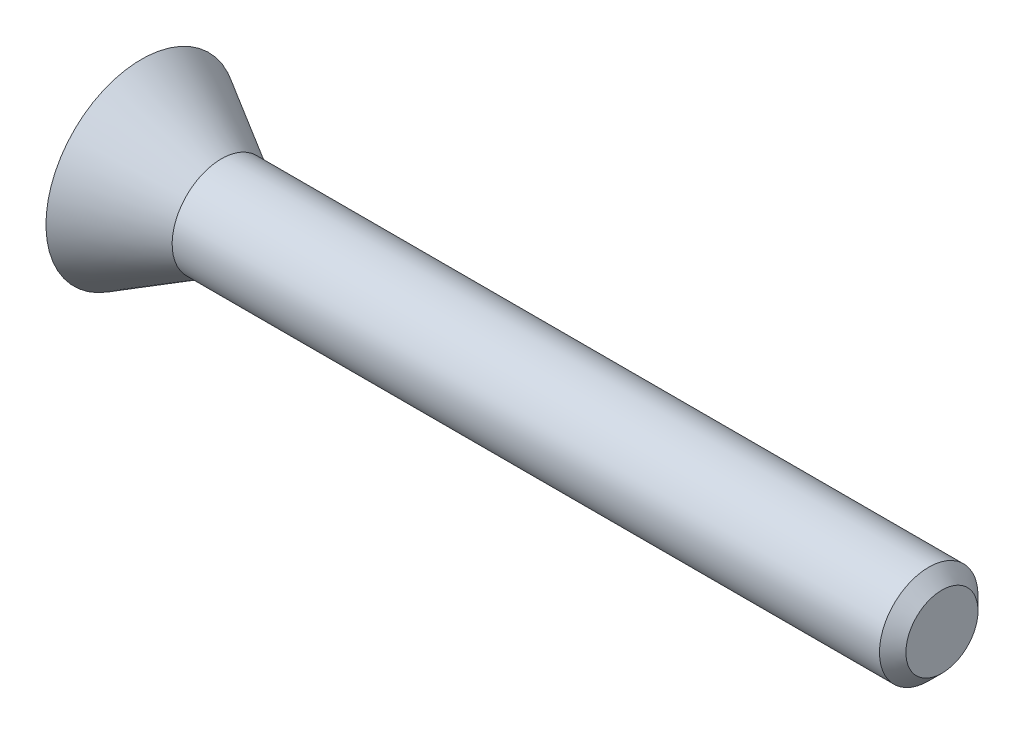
from build123d import *

# Parameters (mm, degrees)
SKETCH1_R           = 1.55
BOSS_EXTRUDE1_DEPTH = 6.5
CUT_EXTRUDE1_DEPTH  = 0.4
CHAMFER1_SIZE       = 0.2145
CUT_EXTRUDE2_DEPTH  = 0.4


with BuildPart() as part:
    # Sketch1 → Boss-Extrude1 (new, symmetric)
    with BuildSketch(Plane(origin=(0, 0, 0), x_dir=(0, 0, -1), z_dir=(1, 0, 0))):
        with Locations(Location((0, 0, 0), (0, 0, 180))):
            Circle(SKETCH1_R)
    extrude(amount=BOSS_EXTRUDE1_DEPTH, both=True)

    # Sketch2 → Cut-Revolve1 (revolve, cut)
    with BuildSketch(Plane.XY, mode=Mode.PRIVATE) as cut_revolve1_sk:
        Polygon((-5.200961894, 0.8), (6.5, 0.8), (6.5, 1.55), (-6.5, 1.55), align=None)
    revolve(cut_revolve1_sk.sketch.rotate(Axis((-6.5, 0, 0), (1, 0, 0)), 180), axis=Axis((-6.5, 0, 0), (1, 0, 0)), mode=Mode.SUBTRACT)

    # Sketch3 → Cut-Extrude1 (cut)
    with BuildSketch(Plane.ZY.offset(6.5)):
        with BuildLine():
            Line((0.155, 0.68), (0.155, -1.025))
            ThreePointArc((0.155, -1.025), (0, -1.18), (-0.155, -1.025))
            Line((-0.155, -1.025), (-0.155, 0.68))
            Line((-0.155, 0.68), (-0.37, 0.68))
            Line((-0.37, 0.68), (0, 1.3))
            Line((0, 1.3), (0.37, 0.68))
            Line((0.37, 0.68), (0.155, 0.68))
        make_face()
    extrude(amount=-CUT_EXTRUDE1_DEPTH, mode=Mode.SUBTRACT)

    # Chamfer1
    chamfer1_edges = [part.edges().sort_by_distance(p)[0] for p in [
        (6.5, 0.8, 0),
    ]]
    chamfer(chamfer1_edges, length=CHAMFER1_SIZE)

    # Sketch4 → Cut-Extrude2 (cut)
    with BuildSketch(Plane.ZY.offset(6.5)):
        with BuildLine():
            Line((1.022475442, -0.75), (1.022475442, -0.528936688))
            Line((1.022475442, -0.528936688), (0.578238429, 0.059598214))
            add(Edge.make_bspline(
                [(0.578238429, 0.059598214), (0.568933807, 0.072708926), (0.550804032, 0.098254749), (0.534395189, 0.133336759), (0.524173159, 0.160841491), (0.519301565, 0.18078785), (0.515826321, 0.199818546), (0.515398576, 0.212323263), (0.515190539, 0.218405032)],
                knots=[0, 0, 0, 0, 1.664252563, 3.24274559, 3.998498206, 4.704056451, 5.369707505, 6, 6, 6, 6], degree=3))
            Line((0.515190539, 0.218405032), (0.515190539, 0.220251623))
            add(Edge.make_bspline(
                [(0.515190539, 0.220251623), (0.515550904, 0.228563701), (0.516241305, 0.244488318), (0.522745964, 0.266926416), (0.533406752, 0.286466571), (0.548675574, 0.302606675), (0.567684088, 0.315372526), (0.590428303, 0.324369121), (0.616610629, 0.329528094), (0.635194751, 0.33017754), (0.6449795, 0.330519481)],
                knots=[0, 0, 0, 0, 1.029992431, 1.973301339, 2.872554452, 3.768620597, 4.704316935, 5.693697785, 6.785705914, 8, 8, 8, 8], degree=3))
            add(Edge.make_bspline(
                [(0.6449795, 0.330519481), (0.654536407, 0.330146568), (0.673105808, 0.329421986), (0.699393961, 0.321391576), (0.72308215, 0.308795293), (0.74350325, 0.290821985), (0.760413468, 0.268255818), (0.774137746, 0.2416823), (0.783459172, 0.210621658), (0.78675647, 0.188387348), (0.788485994, 0.176724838)],
                knots=[0, 0, 0, 0, 0.980828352, 1.905783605, 2.800718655, 3.724477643, 4.680224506, 5.688112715, 6.78735127, 8, 8, 8, 8], degree=3))
            Line((0.788485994, 0.176724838), (1.038567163, 0.175933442))
            add(Edge.make_bspline(
                [(1.038567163, 0.175933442), (1.037333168, 0.191793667), (1.034924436, 0.22120771), (1.027027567, 0.263756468), (1.016821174, 0.303834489), (1.003837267, 0.341433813), (0.9871529, 0.376119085), (0.968407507, 0.408615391), (0.945861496, 0.437917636), (0.921181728, 0.465006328), (0.893692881, 0.488865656), (0.864382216, 0.509912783), (0.832806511, 0.527427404), (0.799445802, 0.541956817), (0.763930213, 0.55298423), (0.726723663, 0.561244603), (0.687399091, 0.566008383), (0.660556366, 0.566587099), (0.646826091, 0.566883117)],
                knots=[0, 0, 0, 0, 1.173229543, 2.290119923, 3.354877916, 4.382703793, 5.372196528, 6.339367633, 7.289741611, 8.236749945, 9.180232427, 10.11040526, 11.033485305, 11.978374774, 12.930610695, 13.916256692, 14.93414813, 16, 16, 16, 16], degree=3))
            add(Edge.make_bspline(
                [(0.646826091, 0.566883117), (0.632041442, 0.566673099), (0.603287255, 0.566264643), (0.561426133, 0.56185548), (0.522039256, 0.555200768), (0.485190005, 0.545465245), (0.451026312, 0.532766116), (0.419445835, 0.517454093), (0.390382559, 0.499398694), (0.364059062, 0.478561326), (0.340374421, 0.455320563), (0.319988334, 0.429440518), (0.302340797, 0.40144435), (0.288545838, 0.370789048), (0.277188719, 0.338195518), (0.26983516, 0.303079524), (0.264879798, 0.265854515), (0.264333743, 0.240229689), (0.264054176, 0.22711039)],
                knots=[0, 0, 0, 0, 1.219700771, 2.37215663, 3.469774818, 4.513610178, 5.512457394, 6.473141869, 7.405450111, 8.330272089, 9.238546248, 10.1372905, 11.043445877, 11.962355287, 12.905558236, 13.886315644, 14.917844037, 16, 16, 16, 16], degree=3))
            Line((0.264054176, 0.22711039), (0.264054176, 0.226055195))
            add(Edge.make_bspline(
                [(0.264054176, 0.226055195), (0.264390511, 0.21126361), (0.265063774, 0.181654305), (0.27114106, 0.137339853), (0.280934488, 0.093251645), (0.294384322, 0.049602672), (0.311092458, 0.007149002), (0.331145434, -0.033527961), (0.35377779, -0.072446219), (0.371711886, -0.096466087), (0.380653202, -0.108441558)],
                knots=[0, 0, 0, 0, 0.984368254, 1.970475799, 2.971844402, 3.988480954, 5.008197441, 6.005725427, 7.005724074, 8, 8, 8, 8], degree=3))
            Line((0.380653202, -0.108441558), (0.699322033, -0.513636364))
            Line((0.699322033, -0.513636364), (0.256931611, -0.513636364))
            Line((0.256931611, -0.513636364), (0.256931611, -0.75))
            Line((0.256931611, -0.75), (1.022475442, -0.75))
        make_face()
        Polygon((-1.007877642, 0.55), (-1.007877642, 0.386972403), (-0.717699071, -0.75), (-0.453372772, -0.75), (-0.734582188, 0.313636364), (-0.512199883, 0.313636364), (-0.512199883, 0.111038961), (-0.268186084, 0.111038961), (-0.268186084, 0.55), align=None)
    extrude(amount=-CUT_EXTRUDE2_DEPTH, mode=Mode.SUBTRACT)


solid = part.part
